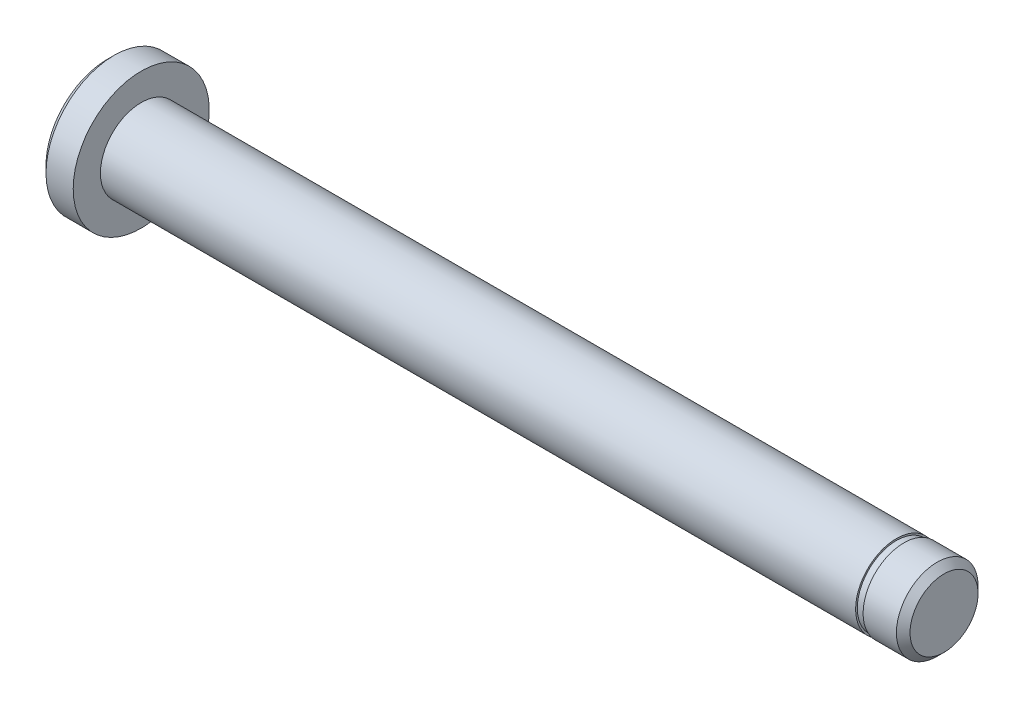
from build123d import *

# Parameters (mm, degrees)
CHANFREIN1_SIZE = 1
CHANFREIN2_SIZE = 1


with BuildPart() as part:
    # Esquisse1 → R_volution1 (revolve)
    with BuildSketch(Plane.XY, mode=Mode.PRIVATE) as r_volution1_sk:
        Polygon((-35.717111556, 0), (-35.717111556, 10), (-30.717111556, 10), (-30.717111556, 6), (80.282888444, 6), (80.282888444, 5.75), (81.382888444, 5.75), (81.382888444, 6), (87.282888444, 6), (87.282888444, 0), align=None)
    revolve(r_volution1_sk.sketch.rotate(Axis((-49.636842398, 0, 0), (1, 0, 0)), 90), axis=Axis((-49.636842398, 0, 0), (1, 0, 0)))

    # Chanfrein1
    chanfrein1_edges = [part.edges().sort_by_distance(p)[0] for p in [
        (87.282888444, 0, -6),
    ]]
    chamfer(chanfrein1_edges, length=CHANFREIN1_SIZE)

    # Chanfrein2
    chanfrein2_edges = [part.edges().sort_by_distance(p)[0] for p in [
        (-35.717111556, 0, -10),
    ]]
    chamfer(chanfrein2_edges, length=CHANFREIN2_SIZE)


solid = part.part
